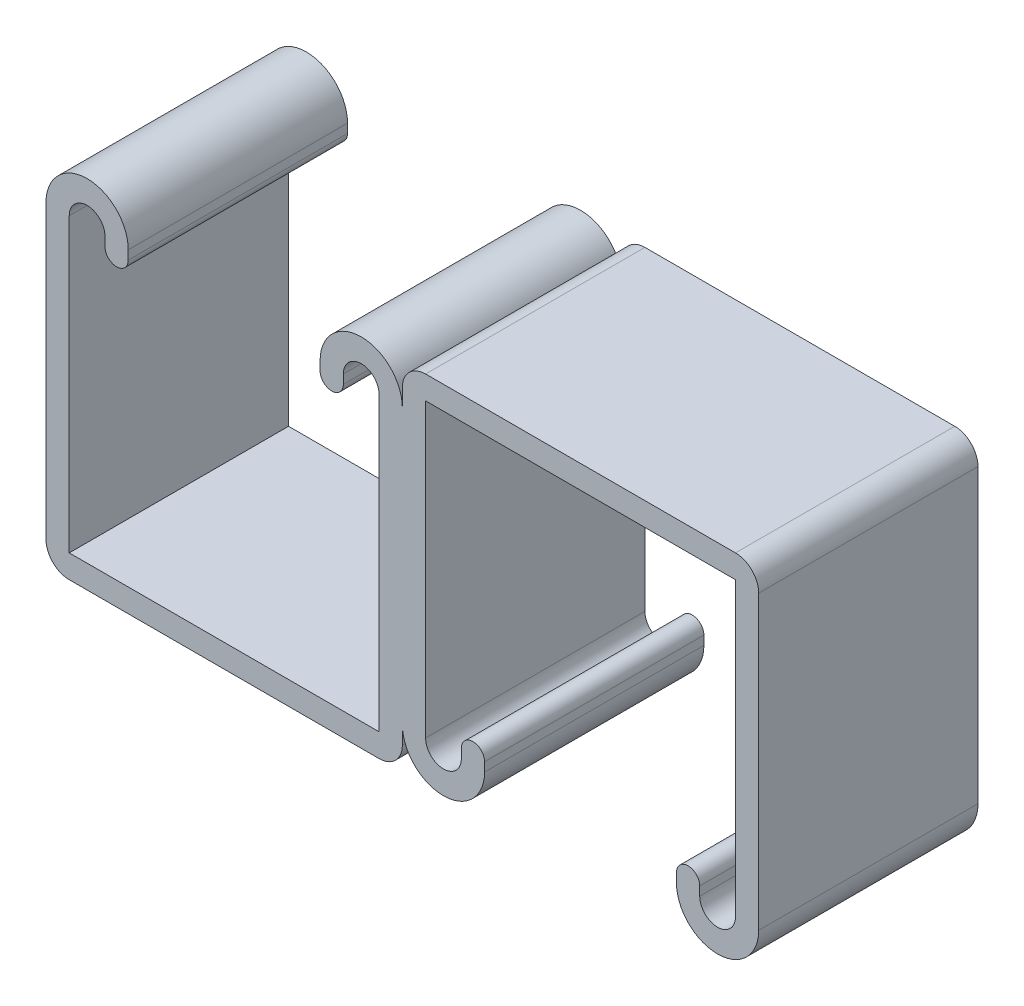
from build123d import *

# Parameters (mm, degrees)
BASE_EXTRUDE_DEPTH = 12.7
CIRPATTERN1_COUNT  = 2


with BuildPart() as part:
    # Sketch1 → Base-Extrude (new, symmetric)
    with BuildSketch(Plane.XY):
        with BuildLine():
            Line((-41.275, 15.875), (-41.275, -17.9451))
            ThreePointArc((-41.275, -17.9451), (-40.486414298, -19.848914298), (-38.5826, -20.6375))
            Line((-38.5826, -20.6375), (-2.6924, -20.6375))
            ThreePointArc((-2.6924, -20.6375), (-0.788585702, -19.848914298), (0, -17.9451))
            Line((0, -17.9451), (0, 15.875))
            ThreePointArc((0, 15.875), (-4.7625, 20.6375), (-9.525, 15.875))
            Line((-9.525, 15.875), (-9.525, 14.83995))
            ThreePointArc((-9.525, 14.83995), (-8.1788, 13.49375), (-6.8326, 14.83995))
            Line((-6.8326, 14.83995), (-6.8326, 15.875))
            ThreePointArc((-6.8326, 15.875), (-4.7625, 17.9451), (-2.6924, 15.875))
            Line((-2.6924, 15.875), (-2.6924, -17.9451))
            Line((-2.6924, -17.9451), (-38.5826, -17.9451))
            Line((-38.5826, -17.9451), (-38.5826, 15.875))
            ThreePointArc((-38.5826, 15.875), (-36.5125, 17.9451), (-34.4424, 15.875))
            Line((-34.4424, 15.875), (-34.4424, 14.83995))
            ThreePointArc((-34.4424, 14.83995), (-33.0962, 13.49375), (-31.75, 14.83995))
            Line((-31.75, 14.83995), (-31.75, 15.875))
            ThreePointArc((-31.75, 15.875), (-36.5125, 20.6375), (-41.275, 15.875))
        make_face()
    base_extrude = extrude(amount=BASE_EXTRUDE_DEPTH, both=True)

    # CirPattern1: Base-Extrude ×2 about axis
    cirpattern1_axis = Axis((0, 0, 0), (0, 0, 1))
    for i in range(1, CIRPATTERN1_COUNT):
        add(base_extrude.rotate(cirpattern1_axis, i * 360 / CIRPATTERN1_COUNT))


solid = part.part
